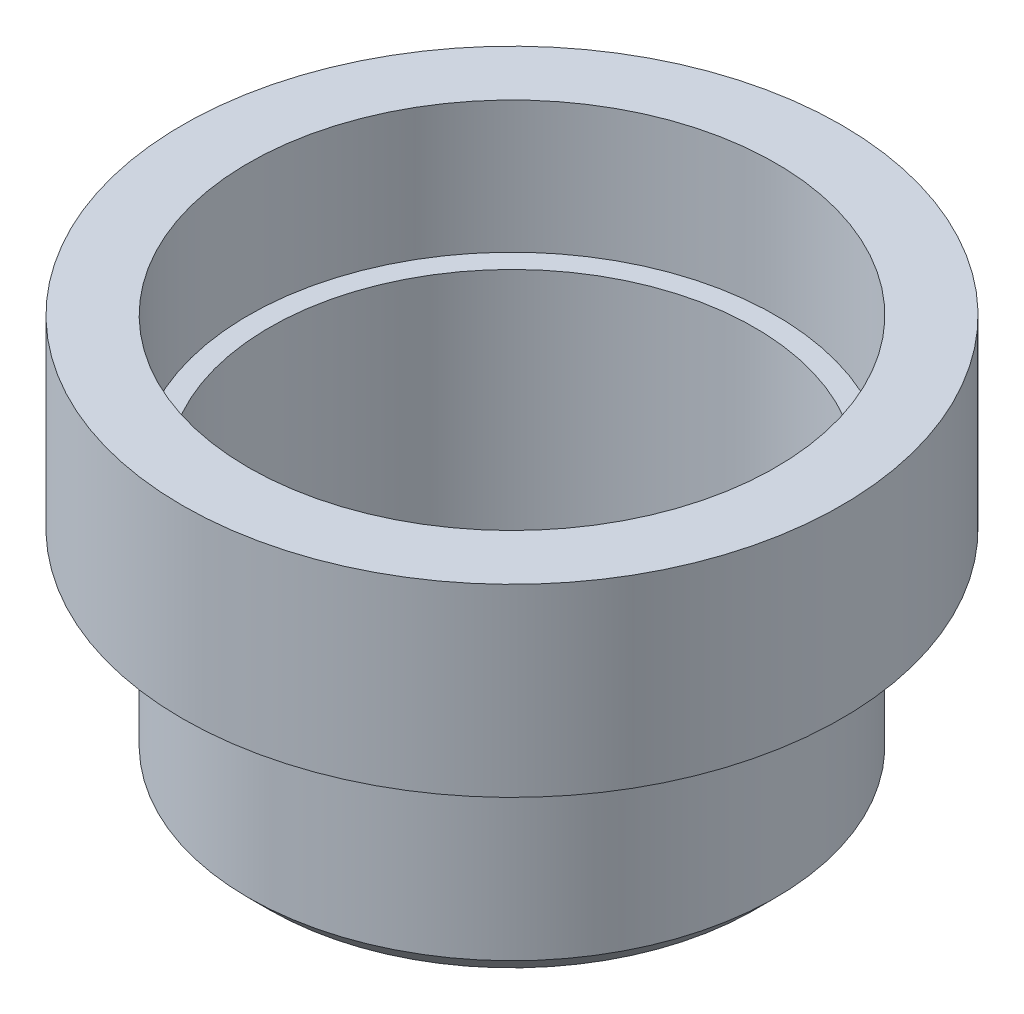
ISO-10303-21;
HEADER;
FILE_DESCRIPTION(('STEP AP214'),'2;1');
FILE_NAME('part.step','',(''),(''),'','','');
FILE_SCHEMA(('AUTOMOTIVE_DESIGN { 1 0 10303 214 1 1 1 1 }'));
ENDSEC;
DATA;
#1=APPLICATION_CONTEXT('core data for automotive mechanical design processes');
#2=APPLICATION_PROTOCOL_DEFINITION('international standard','automotive_design',2000,#1);
#3=PRODUCT_CONTEXT('',#1,'mechanical');
#4=PRODUCT('Part','Part','',(#3));
#5=PRODUCT_RELATED_PRODUCT_CATEGORY('part','',(#4));
#6=PRODUCT_DEFINITION_FORMATION('','',#4);
#7=PRODUCT_DEFINITION_CONTEXT('part definition',#1,'design');
#8=PRODUCT_DEFINITION('design','',#6,#7);
#9=PRODUCT_DEFINITION_SHAPE('','',#8);
#10=(LENGTH_UNIT() NAMED_UNIT(*) SI_UNIT(.MILLI.,.METRE.));
#11=(NAMED_UNIT(*) PLANE_ANGLE_UNIT() SI_UNIT($,.RADIAN.));
#12=(NAMED_UNIT(*) SI_UNIT($,.STERADIAN.) SOLID_ANGLE_UNIT());
#13=UNCERTAINTY_MEASURE_WITH_UNIT(LENGTH_MEASURE(1.E-05),#10,'distance_accuracy_value','');
#14=(GEOMETRIC_REPRESENTATION_CONTEXT(3) GLOBAL_UNCERTAINTY_ASSIGNED_CONTEXT((#13)) GLOBAL_UNIT_ASSIGNED_CONTEXT((#10,
#11,#12)) REPRESENTATION_CONTEXT('',''));
#15=CARTESIAN_POINT('',(0.,0.,0.));
#16=DIRECTION('',(0.,0.,1.));
#17=DIRECTION('',(1.,0.,0.));
#18=AXIS2_PLACEMENT_3D('',#15,#16,#17);
#19=CARTESIAN_POINT('',(0.,0.,0.));
#20=DIRECTION('',(0.,1.,0.));
#21=DIRECTION('',(0.,0.,1.));
#22=AXIS2_PLACEMENT_3D('',#19,#20,#21);
#23=CYLINDRICAL_SURFACE('',#22,11.684);
#24=CARTESIAN_POINT('',(0.,0.0863599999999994,0.));
#25=DIRECTION('',(0.,1.,0.));
#26=DIRECTION('',(0.,0.,1.));
#27=AXIS2_PLACEMENT_3D('',#24,#25,#26);
#28=CIRCLE('',#27,11.684);
#29=CARTESIAN_POINT('',(0.,0.0863599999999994,11.684));
#30=VERTEX_POINT('',#29);
#31=EDGE_CURVE('E43',#30,#30,#28,.F.);
#32=CARTESIAN_POINT('',(0.,12.7,0.));
#33=DIRECTION('',(0.,1.,0.));
#34=DIRECTION('',(0.,0.,1.));
#35=AXIS2_PLACEMENT_3D('',#32,#33,#34);
#36=CIRCLE('',#35,11.684);
#37=CARTESIAN_POINT('',(0.,12.7,11.684));
#38=VERTEX_POINT('',#37);
#39=EDGE_CURVE('E47',#38,#38,#36,.F.);
#40=CARTESIAN_POINT('',(0.,0.0863599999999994,11.684));
#41=CARTESIAN_POINT('',(0.,0.217752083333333,11.684));
#42=CARTESIAN_POINT('',(0.,0.349144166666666,11.684));
#43=CARTESIAN_POINT('',(0.,0.611928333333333,11.684));
#44=CARTESIAN_POINT('',(0.,0.743320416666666,11.684));
#45=CARTESIAN_POINT('',(0.,1.00610458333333,11.684));
#46=CARTESIAN_POINT('',(0.,1.13749666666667,11.684));
#47=CARTESIAN_POINT('',(0.,1.40028083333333,11.684));
#48=CARTESIAN_POINT('',(0.,1.53167291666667,11.684));
#49=CARTESIAN_POINT('',(0.,1.79445708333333,11.684));
#50=CARTESIAN_POINT('',(0.,1.92584916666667,11.684));
#51=CARTESIAN_POINT('',(0.,2.18863333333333,11.684));
#52=CARTESIAN_POINT('',(0.,2.32002541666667,11.684));
#53=CARTESIAN_POINT('',(0.,2.58280958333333,11.684));
#54=CARTESIAN_POINT('',(0.,2.71420166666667,11.684));
#55=CARTESIAN_POINT('',(0.,2.97698583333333,11.684));
#56=CARTESIAN_POINT('',(0.,3.10837791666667,11.684));
#57=CARTESIAN_POINT('',(0.,3.37116208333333,11.684));
#58=CARTESIAN_POINT('',(0.,3.50255416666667,11.684));
#59=CARTESIAN_POINT('',(0.,3.76533833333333,11.684));
#60=CARTESIAN_POINT('',(0.,3.89673041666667,11.684));
#61=CARTESIAN_POINT('',(0.,4.15951458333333,11.684));
#62=CARTESIAN_POINT('',(0.,4.29090666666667,11.684));
#63=CARTESIAN_POINT('',(0.,4.55369083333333,11.684));
#64=CARTESIAN_POINT('',(0.,4.68508291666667,11.684));
#65=CARTESIAN_POINT('',(0.,4.94786708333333,11.684));
#66=CARTESIAN_POINT('',(0.,5.07925916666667,11.684));
#67=CARTESIAN_POINT('',(0.,5.34204333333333,11.684));
#68=CARTESIAN_POINT('',(0.,5.47343541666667,11.684));
#69=CARTESIAN_POINT('',(0.,5.73621958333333,11.684));
#70=CARTESIAN_POINT('',(0.,5.86761166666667,11.684));
#71=CARTESIAN_POINT('',(0.,6.13039583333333,11.684));
#72=CARTESIAN_POINT('',(0.,6.26178791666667,11.684));
#73=CARTESIAN_POINT('',(0.,6.52457208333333,11.684));
#74=CARTESIAN_POINT('',(0.,6.65596416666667,11.684));
#75=CARTESIAN_POINT('',(0.,6.91874833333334,11.684));
#76=CARTESIAN_POINT('',(0.,7.05014041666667,11.684));
#77=CARTESIAN_POINT('',(0.,7.31292458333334,11.684));
#78=CARTESIAN_POINT('',(0.,7.44431666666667,11.684));
#79=CARTESIAN_POINT('',(0.,7.70710083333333,11.684));
#80=CARTESIAN_POINT('',(0.,7.83849291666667,11.684));
#81=CARTESIAN_POINT('',(0.,8.10127708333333,11.684));
#82=CARTESIAN_POINT('',(0.,8.23266916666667,11.684));
#83=CARTESIAN_POINT('',(0.,8.49545333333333,11.684));
#84=CARTESIAN_POINT('',(0.,8.62684541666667,11.684));
#85=CARTESIAN_POINT('',(0.,8.88962958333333,11.684));
#86=CARTESIAN_POINT('',(0.,9.02102166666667,11.684));
#87=CARTESIAN_POINT('',(0.,9.28380583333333,11.684));
#88=CARTESIAN_POINT('',(0.,9.41519791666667,11.684));
#89=CARTESIAN_POINT('',(0.,9.67798208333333,11.684));
#90=CARTESIAN_POINT('',(0.,9.80937416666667,11.684));
#91=CARTESIAN_POINT('',(0.,10.0721583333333,11.684));
#92=CARTESIAN_POINT('',(0.,10.2035504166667,11.684));
#93=CARTESIAN_POINT('',(0.,10.4663345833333,11.684));
#94=CARTESIAN_POINT('',(0.,10.5977266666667,11.684));
#95=CARTESIAN_POINT('',(0.,10.8605108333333,11.684));
#96=CARTESIAN_POINT('',(0.,10.9919029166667,11.684));
#97=CARTESIAN_POINT('',(0.,11.2546870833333,11.684));
#98=CARTESIAN_POINT('',(0.,11.3860791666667,11.684));
#99=CARTESIAN_POINT('',(0.,11.6488633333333,11.684));
#100=CARTESIAN_POINT('',(0.,11.7802554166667,11.684));
#101=CARTESIAN_POINT('',(0.,12.0430395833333,11.684));
#102=CARTESIAN_POINT('',(0.,12.1744316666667,11.684));
#103=CARTESIAN_POINT('',(0.,12.4372158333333,11.684));
#104=CARTESIAN_POINT('',(0.,12.5686079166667,11.684));
#105=CARTESIAN_POINT('',(0.,12.7,11.684));
#106=B_SPLINE_CURVE_WITH_KNOTS('',3,(#40,#41,#42,#43,#44,#45,#46,#47,#48,#49,#50,#51,#52,#53,
#54,#55,#56,#57,#58,#59,#60,#61,#62,#63,#64,#65,#66,#67,#68,#69,#70,#71,#72,#73,#74,#75,#76,#77,
#78,#79,#80,#81,#82,#83,#84,#85,#86,#87,#88,#89,#90,#91,#92,#93,#94,#95,#96,#97,#98,#99,#100,
#101,#102,#103,#104,#105),.UNSPECIFIED.,.F.,.F.,(4,2,2,2,2,2,2,2,2,2,2,2,2,2,2,2,2,2,2,2,2,2,2,
2,2,2,2,2,2,2,2,2,4),(0.,0.39417625,0.7883525,1.18252875,1.576705,1.97088125,2.3650575,
2.75923375,3.15341,3.54758625,3.9417625,4.33593875,4.730115,5.12429125,5.5184675,5.91264375,
6.30682,6.70099625,7.0951725,7.48934875,7.883525,8.27770125,8.6718775,9.06605375,9.46023,
9.85440625,10.2485825,10.64275875,11.036935,11.43111125,11.8252875,12.21946375,12.61364),.UNSPECIFIED.);
#107=EDGE_CURVE('BSEAM39',#30,#38,#106,.T.);
#108=ORIENTED_EDGE('',*,*,#31,.T.);
#109=ORIENTED_EDGE('',*,*,#39,.F.);
#110=ORIENTED_EDGE('',*,*,#107,.T.);
#111=ORIENTED_EDGE('',*,*,#107,.F.);
#112=EDGE_LOOP('',(#108,#110,#109,#111));
#113=FACE_BOUND('',#112,.T.);
#114=ADVANCED_FACE('F39',(#113),#23,.F.);
#115=CARTESIAN_POINT('',(0.,19.05,0.));
#116=DIRECTION('',(0.,-1.,0.));
#117=DIRECTION('',(0.,0.,-1.));
#118=AXIS2_PLACEMENT_3D('',#115,#116,#117);
#119=CYLINDRICAL_SURFACE('',#118,15.875);
#120=CARTESIAN_POINT('',(0.,10.16,0.));
#121=DIRECTION('',(0.,1.,0.));
#122=DIRECTION('',(0.,0.,1.));
#123=AXIS2_PLACEMENT_3D('',#120,#121,#122);
#124=CIRCLE('',#123,15.875);
#125=CARTESIAN_POINT('',(0.,10.16,-15.875));
#126=VERTEX_POINT('',#125);
#127=EDGE_CURVE('E62',#126,#126,#124,.T.);
#128=CARTESIAN_POINT('',(0.,19.05,0.));
#129=DIRECTION('',(0.,1.,0.));
#130=DIRECTION('',(0.,0.,1.));
#131=AXIS2_PLACEMENT_3D('',#128,#129,#130);
#132=CIRCLE('',#131,15.875);
#133=CARTESIAN_POINT('',(0.,19.05,-15.875));
#134=VERTEX_POINT('',#133);
#135=EDGE_CURVE('E10',#134,#134,#132,.T.);
#136=CARTESIAN_POINT('',(0.,10.16,-15.875));
#137=CARTESIAN_POINT('',(0.,10.2526041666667,-15.875));
#138=CARTESIAN_POINT('',(0.,10.3452083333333,-15.875));
#139=CARTESIAN_POINT('',(0.,10.5304166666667,-15.875));
#140=CARTESIAN_POINT('',(0.,10.6230208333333,-15.875));
#141=CARTESIAN_POINT('',(0.,10.8082291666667,-15.875));
#142=CARTESIAN_POINT('',(0.,10.9008333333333,-15.875));
#143=CARTESIAN_POINT('',(0.,11.0860416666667,-15.875));
#144=CARTESIAN_POINT('',(0.,11.1786458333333,-15.875));
#145=CARTESIAN_POINT('',(0.,11.3638541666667,-15.875));
#146=CARTESIAN_POINT('',(0.,11.4564583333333,-15.875));
#147=CARTESIAN_POINT('',(0.,11.6416666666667,-15.875));
#148=CARTESIAN_POINT('',(0.,11.7342708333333,-15.875));
#149=CARTESIAN_POINT('',(0.,11.9194791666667,-15.875));
#150=CARTESIAN_POINT('',(0.,12.0120833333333,-15.875));
#151=CARTESIAN_POINT('',(0.,12.1972916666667,-15.875));
#152=CARTESIAN_POINT('',(0.,12.2898958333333,-15.875));
#153=CARTESIAN_POINT('',(0.,12.4751041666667,-15.875));
#154=CARTESIAN_POINT('',(0.,12.5677083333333,-15.875));
#155=CARTESIAN_POINT('',(0.,12.7529166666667,-15.875));
#156=CARTESIAN_POINT('',(0.,12.8455208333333,-15.875));
#157=CARTESIAN_POINT('',(0.,13.0307291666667,-15.875));
#158=CARTESIAN_POINT('',(0.,13.1233333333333,-15.875));
#159=CARTESIAN_POINT('',(0.,13.3085416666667,-15.875));
#160=CARTESIAN_POINT('',(0.,13.4011458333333,-15.875));
#161=CARTESIAN_POINT('',(0.,13.5863541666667,-15.875));
#162=CARTESIAN_POINT('',(0.,13.6789583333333,-15.875));
#163=CARTESIAN_POINT('',(0.,13.8641666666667,-15.875));
#164=CARTESIAN_POINT('',(0.,13.9567708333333,-15.875));
#165=CARTESIAN_POINT('',(0.,14.1419791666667,-15.875));
#166=CARTESIAN_POINT('',(0.,14.2345833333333,-15.875));
#167=CARTESIAN_POINT('',(0.,14.4197916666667,-15.875));
#168=CARTESIAN_POINT('',(0.,14.5123958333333,-15.875));
#169=CARTESIAN_POINT('',(0.,14.6976041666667,-15.875));
#170=CARTESIAN_POINT('',(0.,14.7902083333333,-15.875));
#171=CARTESIAN_POINT('',(0.,14.9754166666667,-15.875));
#172=CARTESIAN_POINT('',(0.,15.0680208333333,-15.875));
#173=CARTESIAN_POINT('',(0.,15.2532291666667,-15.875));
#174=CARTESIAN_POINT('',(0.,15.3458333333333,-15.875));
#175=CARTESIAN_POINT('',(0.,15.5310416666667,-15.875));
#176=CARTESIAN_POINT('',(0.,15.6236458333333,-15.875));
#177=CARTESIAN_POINT('',(0.,15.8088541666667,-15.875));
#178=CARTESIAN_POINT('',(0.,15.9014583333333,-15.875));
#179=CARTESIAN_POINT('',(0.,16.0866666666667,-15.875));
#180=CARTESIAN_POINT('',(0.,16.1792708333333,-15.875));
#181=CARTESIAN_POINT('',(0.,16.3644791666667,-15.875));
#182=CARTESIAN_POINT('',(0.,16.4570833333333,-15.875));
#183=CARTESIAN_POINT('',(0.,16.6422916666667,-15.875));
#184=CARTESIAN_POINT('',(0.,16.7348958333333,-15.875));
#185=CARTESIAN_POINT('',(0.,16.9201041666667,-15.875));
#186=CARTESIAN_POINT('',(0.,17.0127083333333,-15.875));
#187=CARTESIAN_POINT('',(0.,17.1979166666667,-15.875));
#188=CARTESIAN_POINT('',(0.,17.2905208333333,-15.875));
#189=CARTESIAN_POINT('',(0.,17.4757291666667,-15.875));
#190=CARTESIAN_POINT('',(0.,17.5683333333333,-15.875));
#191=CARTESIAN_POINT('',(0.,17.7535416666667,-15.875));
#192=CARTESIAN_POINT('',(0.,17.8461458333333,-15.875));
#193=CARTESIAN_POINT('',(0.,18.0313541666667,-15.875));
#194=CARTESIAN_POINT('',(0.,18.1239583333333,-15.875));
#195=CARTESIAN_POINT('',(0.,18.3091666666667,-15.875));
#196=CARTESIAN_POINT('',(0.,18.4017708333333,-15.875));
#197=CARTESIAN_POINT('',(0.,18.5869791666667,-15.875));
#198=CARTESIAN_POINT('',(0.,18.6795833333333,-15.875));
#199=CARTESIAN_POINT('',(0.,18.8647916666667,-15.875));
#200=CARTESIAN_POINT('',(0.,18.9573958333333,-15.875));
#201=CARTESIAN_POINT('',(0.,19.05,-15.875));
#202=B_SPLINE_CURVE_WITH_KNOTS('',3,(#136,#137,#138,#139,#140,#141,#142,#143,#144,#145,#146,
#147,#148,#149,#150,#151,#152,#153,#154,#155,#156,#157,#158,#159,#160,#161,#162,#163,#164,#165,
#166,#167,#168,#169,#170,#171,#172,#173,#174,#175,#176,#177,#178,#179,#180,#181,#182,#183,#184,
#185,#186,#187,#188,#189,#190,#191,#192,#193,#194,#195,#196,#197,#198,#199,#200,#201),
.UNSPECIFIED.,.F.,.F.,(4,2,2,2,2,2,2,2,2,2,2,2,2,2,2,2,2,2,2,2,2,2,2,2,2,2,2,2,2,2,2,2,4),(0.,
0.2778125,0.555625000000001,0.833437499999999,1.11125,1.3890625,1.666875,1.9446875,2.2225,
2.5003125,2.778125,3.0559375,3.33375,3.6115625,3.889375,4.1671875,4.445,4.7228125,5.000625,
5.2784375,5.55625,5.8340625,6.111875,6.3896875,6.6675,6.9453125,7.223125,7.5009375,7.77875,
8.0565625,8.334375,8.6121875,8.89),.UNSPECIFIED.);
#203=EDGE_CURVE('BSEAM41',#126,#134,#202,.T.);
#204=ORIENTED_EDGE('',*,*,#127,.T.);
#205=ORIENTED_EDGE('',*,*,#135,.F.);
#206=ORIENTED_EDGE('',*,*,#203,.T.);
#207=ORIENTED_EDGE('',*,*,#203,.F.);
#208=EDGE_LOOP('',(#204,#206,#205,#207));
#209=FACE_BOUND('',#208,.T.);
#210=ADVANCED_FACE('F41',(#209),#119,.T.);
#211=CARTESIAN_POINT('',(0.,19.05,0.));
#212=DIRECTION('',(0.,1.,0.));
#213=DIRECTION('',(0.,0.,1.));
#214=AXIS2_PLACEMENT_3D('',#211,#212,#213);
#215=PLANE('',#214);
#216=CARTESIAN_POINT('',(0.,19.05,0.));
#217=DIRECTION('',(0.,1.,0.));
#218=DIRECTION('',(0.,0.,1.));
#219=AXIS2_PLACEMENT_3D('',#216,#217,#218);
#220=CIRCLE('',#219,12.7);
#221=CARTESIAN_POINT('',(0.,19.05,12.7));
#222=VERTEX_POINT('',#221);
#223=EDGE_CURVE('E54',#222,#222,#220,.T.);
#224=ORIENTED_EDGE('',*,*,#223,.F.);
#225=EDGE_LOOP('',(#224));
#226=FACE_BOUND('',#225,.T.);
#227=ORIENTED_EDGE('',*,*,#135,.T.);
#228=EDGE_LOOP('',(#227));
#229=FACE_BOUND('',#228,.T.);
#230=ADVANCED_FACE('F86',(#226,#229),#215,.T.);
#231=CARTESIAN_POINT('',(0.,12.7,0.));
#232=DIRECTION('',(0.,1.,0.));
#233=DIRECTION('',(0.,0.,1.));
#234=AXIS2_PLACEMENT_3D('',#231,#232,#233);
#235=PLANE('',#234);
#236=CARTESIAN_POINT('',(0.,12.7,0.));
#237=DIRECTION('',(0.,1.,0.));
#238=DIRECTION('',(0.,0.,1.));
#239=AXIS2_PLACEMENT_3D('',#236,#237,#238);
#240=CIRCLE('',#239,12.7);
#241=CARTESIAN_POINT('',(0.,12.7,12.7));
#242=VERTEX_POINT('',#241);
#243=EDGE_CURVE('E52',#242,#242,#240,.T.);
#244=ORIENTED_EDGE('',*,*,#243,.T.);
#245=EDGE_LOOP('',(#244));
#246=FACE_BOUND('',#245,.T.);
#247=ORIENTED_EDGE('',*,*,#39,.T.);
#248=EDGE_LOOP('',(#247));
#249=FACE_BOUND('',#248,.T.);
#250=ADVANCED_FACE('F84',(#246,#249),#235,.T.);
#251=CARTESIAN_POINT('',(0.,12.7,0.));
#252=DIRECTION('',(0.,1.,0.));
#253=DIRECTION('',(0.,0.,1.));
#254=AXIS2_PLACEMENT_3D('',#251,#252,#253);
#255=CYLINDRICAL_SURFACE('',#254,12.7);
#256=ORIENTED_EDGE('',*,*,#243,.F.);
#257=EDGE_LOOP('',(#256));
#258=FACE_BOUND('',#257,.T.);
#259=ORIENTED_EDGE('',*,*,#223,.T.);
#260=EDGE_LOOP('',(#259));
#261=FACE_BOUND('',#260,.T.);
#262=ADVANCED_FACE('F74',(#258,#261),#255,.F.);
#263=CARTESIAN_POINT('',(0.,0.,0.));
#264=DIRECTION('',(0.,1.,0.));
#265=DIRECTION('',(0.,0.,1.));
#266=AXIS2_PLACEMENT_3D('',#263,#264,#265);
#267=CONICAL_SURFACE('',#266,11.59764,0.785398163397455);
#268=CARTESIAN_POINT('',(0.,1.10235999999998,0.));
#269=DIRECTION('',(0.,1.,0.));
#270=DIRECTION('',(0.,0.,1.));
#271=AXIS2_PLACEMENT_3D('',#268,#269,#270);
#272=CIRCLE('',#271,12.7);
#273=CARTESIAN_POINT('',(0.,1.10235999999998,12.7));
#274=VERTEX_POINT('',#273);
#275=EDGE_CURVE('E65',#274,#274,#272,.T.);
#276=ORIENTED_EDGE('',*,*,#275,.F.);
#277=EDGE_LOOP('',(#276));
#278=FACE_BOUND('',#277,.T.);
#279=ORIENTED_EDGE('',*,*,#31,.F.);
#280=EDGE_LOOP('',(#279));
#281=FACE_BOUND('',#280,.T.);
#282=ADVANCED_FACE('F71',(#278,#281),#267,.T.);
#283=CARTESIAN_POINT('',(0.,0.,0.));
#284=DIRECTION('',(0.,1.,0.));
#285=DIRECTION('',(0.,0.,1.));
#286=AXIS2_PLACEMENT_3D('',#283,#284,#285);
#287=CYLINDRICAL_SURFACE('',#286,12.7);
#288=CARTESIAN_POINT('',(0.,10.16,0.));
#289=DIRECTION('',(0.,1.,0.));
#290=DIRECTION('',(0.,0.,1.));
#291=AXIS2_PLACEMENT_3D('',#288,#289,#290);
#292=CIRCLE('',#291,12.7);
#293=CARTESIAN_POINT('',(0.,10.16,12.7));
#294=VERTEX_POINT('',#293);
#295=EDGE_CURVE('E59',#294,#294,#292,.T.);
#296=ORIENTED_EDGE('',*,*,#295,.F.);
#297=EDGE_LOOP('',(#296));
#298=FACE_BOUND('',#297,.T.);
#299=ORIENTED_EDGE('',*,*,#275,.T.);
#300=EDGE_LOOP('',(#299));
#301=FACE_BOUND('',#300,.T.);
#302=ADVANCED_FACE('F69',(#298,#301),#287,.T.);
#303=CARTESIAN_POINT('',(12.7,10.16,0.));
#304=DIRECTION('',(0.,1.,0.));
#305=DIRECTION('',(0.,0.,1.));
#306=AXIS2_PLACEMENT_3D('',#303,#304,#305);
#307=PLANE('',#306);
#308=ORIENTED_EDGE('',*,*,#127,.F.);
#309=EDGE_LOOP('',(#308));
#310=FACE_BOUND('',#309,.T.);
#311=ORIENTED_EDGE('',*,*,#295,.T.);
#312=EDGE_LOOP('',(#311));
#313=FACE_BOUND('',#312,.T.);
#314=ADVANCED_FACE('F99',(#310,#313),#307,.F.);
#315=CLOSED_SHELL('',(#114,#210,#230,#250,#262,#282,#302,#314));
#316=MANIFOLD_SOLID_BREP('B2',#315);
#317=ADVANCED_BREP_SHAPE_REPRESENTATION('',(#18,#316),#14);
#318=SHAPE_DEFINITION_REPRESENTATION(#9,#317);
ENDSEC;
END-ISO-10303-21;
